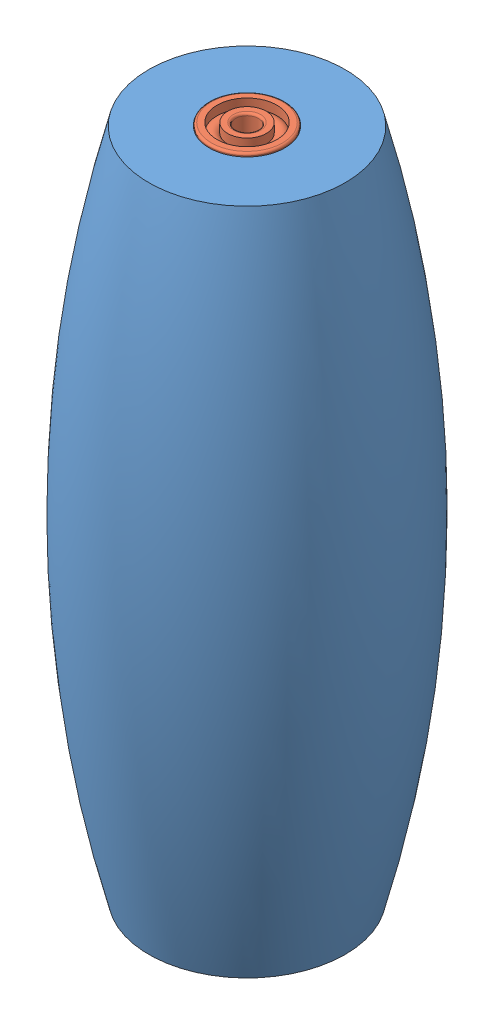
SolidWorks assembly satellitewheel_assembly_2.SLDASM, configuration Default (file format 11000). Lengths in mm.
Overall size (550.8 76.63 18.72).
4 component instances, 3 part files, 7 mates.
Components (placement in the parent):
- Satellite Wheel-1: Satellite Wheel.SLDPRT [Default] at (-230.7088 -10.4586 -3.6611) size (550.8 71.36 18.72)
- instrument ball bearing_68_am-1: instrument ball bearing_68_am.sldprt [AFBMA 12.1.4.1 - 0015-5 - 8,SI,NC,8_68] at (-249.7985 1.4263 -3.6611) x (0 1 0) z (0.469874 0 0.882734) size (2 5 5)
- instrument ball bearing_68_am-3: instrument ball bearing_68_am.sldprt [AFBMA 12.1.4.1 - 0015-5 - 8,SI,NC,8_68] at (-249.7985 -41.1817 -3.6611) x (0 -1 0) z (0.579803 0 0.814757) size (2 5 5)
- wheelshaft-1: wheelshaft.SLDPRT [Default] at (-249.7985 1.7223 -3.6611) x (-0.300283 0 0.95385) z (0 -1 0) size (2.35 2.35 54.72)
Mates (geometry in assembly coordinates):
- Concentric1: concentric: cylinder of Satellite Wheel-1 through (-249.7985 0.4263 -3.6611) axis (0 1 0) radius 2.35; cylinder of instrument ball bearing_68_am-1 through (-249.7985 -19.2112 -3.6611) axis (0 1 0) radius 0.75
- Concentric2: concentric: cylinder of instrument ball bearing_68_am-1 through (-249.7985 -14.8069 -3.6611) axis (0 1 0) radius 2.5; cylinder of ? through (-249.7985 -14.4053 -3.6611) axis (0 1 0) radius 0.75
- Concentric3: concentric: cylinder of Satellite Wheel-1 through (-249.7985 -40.1817 -3.6611) axis (0 -1 0) radius 2.35; cylinder of instrument ball bearing_68_am-3 through (-249.7985 -20.5442 -3.6611) axis (0 -1 0) radius 0.75
- Coincident2: coincident: plane of Satellite Wheel-1 through (-249.7985 -40.1817 -3.6611) normal (0 -1 0); plane of instrument ball bearing_68_am-3 through (-248.1893 -40.1817 -4.8062) normal (0 1 0)
- Coincident3: coincident: plane of Satellite Wheel-1 through (-249.7985 0.4263 -3.6611) normal (0 1 0); plane of instrument ball bearing_68_am-1 through (-251.5419 0.4263 -2.7331) normal (0 -1 0)
- Concentric4: concentric: cylinder of instrument ball bearing_68_am-3 through (-249.7985 -20.5442 -3.6611) axis (0 -1 0) radius 0.75; cylinder of wheelshaft-1 through (-249.7985 -47.2317 -3.6611) axis (0 1 0) radius 0.705
- Width1: width: plane of wheelshaft-1 through (-249.7985 -47.2317 -3.6611) normal (0 -1 0); plane of wheelshaft-1 through (-249.7985 7.4763 -3.6611) normal (0 1 0); plane of Satellite Wheel-1 through (-231.8542 2.2123 -3.6611) normal (0 1 0); plane of Satellite Wheel-1 through (-231.8542 -41.9677 -3.6611) normal (0 -1 0)
